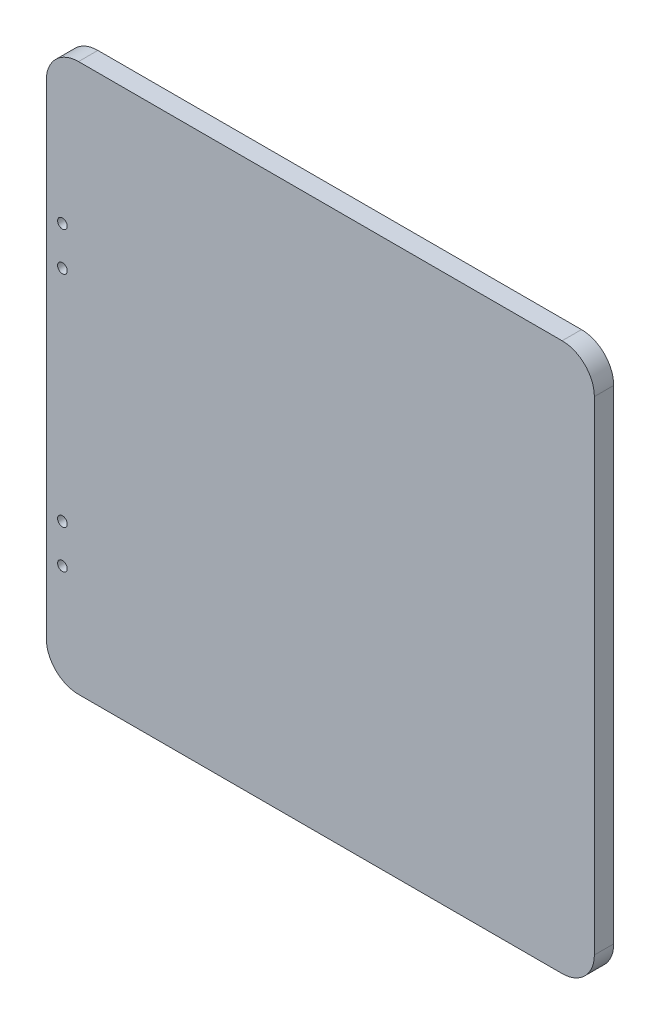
from build123d import *

# Parameters (mm, degrees)
SKETCH1_W           = 170
SKETCH1_H           = 170
BOSS_EXTRUDE1_DEPTH = 6
FILLET1_R           = 10
CUT_EXTRUDE1_REACH  = 122.358
SKETCH2_R           = 1.5
CUT_EXTRUDE2_DEPTH  = 3


with BuildPart() as part:
    # Sketch1 → Boss-Extrude1 (new body)
    with BuildSketch(Plane.XY):
        Rectangle(SKETCH1_W, SKETCH1_H)
    extrude(amount=BOSS_EXTRUDE1_DEPTH)

    # Fillet1
    fillet1_edges = [part.edges().sort_by_distance(p)[0] for p in [
        (-85, 85, 3),
        (85, 85, 3),
        (85, -85, 3),
        (-85, -85, 3),
    ]]
    fillet(fillet1_edges, radius=FILLET1_R)

    # Sketch2 → Cut-Extrude1 (cut, up to next)
    with BuildSketch(Plane.XY.offset(6), mode=Mode.PRIVATE) as cut_extrude1_sk1:
        with Locations((-80, 39)):
            Circle(SKETCH2_R)
    cut_extrude1_tool1 = extrude(cut_extrude1_sk1.sketch, amount=-CUT_EXTRUDE1_REACH, mode=Mode.PRIVATE) & part.part
    # Sketch2 → Cut-Extrude1 (cut, up to next)
    with BuildSketch(Plane.XY.offset(6), mode=Mode.PRIVATE) as cut_extrude1_sk2:
        with Locations((-80, 27)):
            Circle(SKETCH2_R)
    cut_extrude1_tool2 = extrude(cut_extrude1_sk2.sketch, amount=-CUT_EXTRUDE1_REACH, mode=Mode.PRIVATE) & part.part
    # Sketch2 → Cut-Extrude1 (cut, up to next)
    with BuildSketch(Plane.XY.offset(6), mode=Mode.PRIVATE) as cut_extrude1_sk3:
        with Locations((-80, -41)):
            Circle(SKETCH2_R)
    cut_extrude1_tool3 = extrude(cut_extrude1_sk3.sketch, amount=-CUT_EXTRUDE1_REACH, mode=Mode.PRIVATE) & part.part
    # Sketch2 → Cut-Extrude1 (cut, up to next)
    with BuildSketch(Plane.XY.offset(6), mode=Mode.PRIVATE) as cut_extrude1_sk4:
        with Locations((-80, -53)):
            Circle(SKETCH2_R)
    cut_extrude1_tool4 = extrude(cut_extrude1_sk4.sketch, amount=-CUT_EXTRUDE1_REACH, mode=Mode.PRIVATE) & part.part
    add(cut_extrude1_tool1.solids().sort_by_distance((-80, 39, 6))[0], mode=Mode.SUBTRACT)
    add(cut_extrude1_tool2.solids().sort_by_distance((-80, 27, 6))[0], mode=Mode.SUBTRACT)
    add(cut_extrude1_tool3.solids().sort_by_distance((-80, -41, 6))[0], mode=Mode.SUBTRACT)
    add(cut_extrude1_tool4.solids().sort_by_distance((-80, -53, 6))[0], mode=Mode.SUBTRACT)

    # Sketch3 → Cut-Extrude2 (cut)
    with BuildSketch(Plane(origin=(0, 0, 0), x_dir=(-1, 0, 0), z_dir=(0, 0, -1))):
        Polygon((77.25, 40.58771324), (77.25, 37.41228676), (80, 35.824573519), (82.75, 37.41228676), (82.75, 40.58771324), (80, 42.175426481), align=None)
        Polygon((77.25, 28.58771324), (77.25, 25.41228676), (80, 23.824573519), (82.75, 25.41228676), (82.75, 28.58771324), (80, 30.175426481), align=None)
        Polygon((77.25, -39.41228676), (77.25, -42.58771324), (80, -44.175426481), (82.75, -42.58771324), (82.75, -39.41228676), (80, -37.824573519), align=None)
        Polygon((77.25, -51.41228676), (77.25, -54.58771324), (80, -56.175426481), (82.75, -54.58771324), (82.75, -51.41228676), (80, -49.824573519), align=None)
    extrude(amount=-CUT_EXTRUDE2_DEPTH, mode=Mode.SUBTRACT)


solid = part.part
